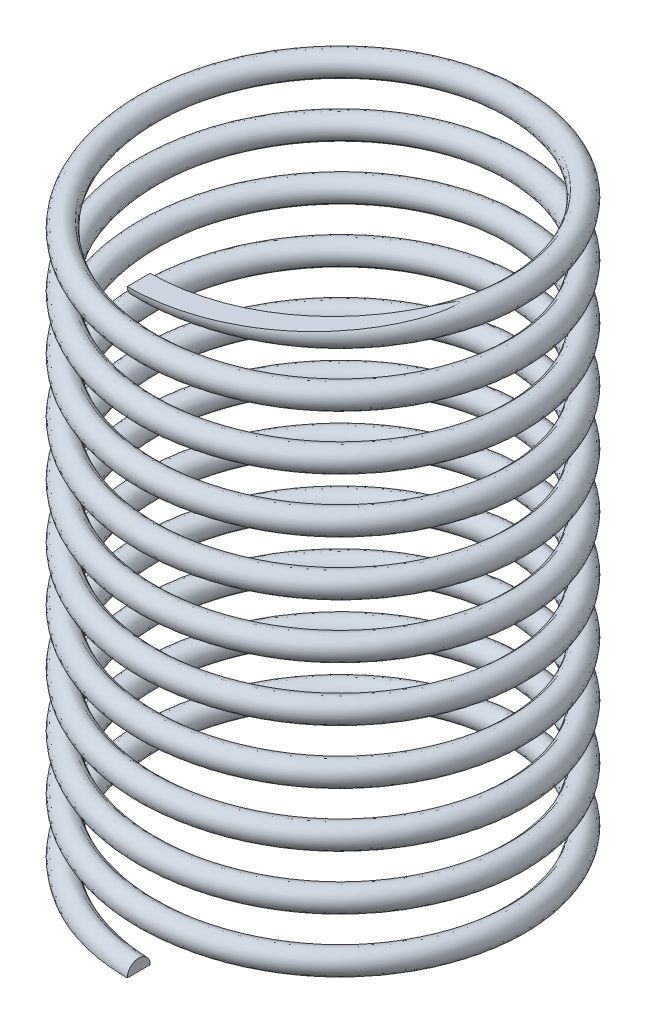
from build123d import *

# Parameters (mm, degrees)
BALAYAGE1_PITCH         = 0.590909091
BALAYAGE1_HEIGHT        = 6.5
BALAYAGE1_RADIUS        = 2
ESQUISSE2_R             = 0.125
ESQUISSE3_W             = 3.434887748
ESQUISSE3_H             = 0.853915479
ESQUISSE3_W_2           = 3.114724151
ESQUISSE3_H_2           = 3.504564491
ENL_V_MAT_EXTRU_1_DEPTH = 5


with BuildPart() as part:
    # Balayage1: sweep along a helix
    with BuildLine() as balayage1_path:
        Helix(BALAYAGE1_PITCH, BALAYAGE1_HEIGHT, BALAYAGE1_RADIUS, center=(0, 0, 0), direction=(0, 1, 0), lefthand=True)
    # Esquisse2 → Balayage1 (sweep)
    with BuildSketch(Plane(origin=(0, 0, 0), x_dir=(0, 0, -1), z_dir=(1, 0, 0))):
        with Locations((-2, 0)):
            Circle(ESQUISSE2_R)
    sweep(path=balayage1_path.line, is_frenet=True)

    # Esquisse3 → Enl_v. mat.-Extru.1 (cut, symmetric)
    with BuildSketch(Plane.XY):
        with Locations((-1.717443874, -0.42695774)):
            Rectangle(ESQUISSE3_W, ESQUISSE3_H)
        with Locations((1.557362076, 8.252282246)):
            Rectangle(ESQUISSE3_W_2, ESQUISSE3_H_2)
    extrude(amount=ENL_V_MAT_EXTRU_1_DEPTH, both=True, mode=Mode.SUBTRACT)


solid = part.part
